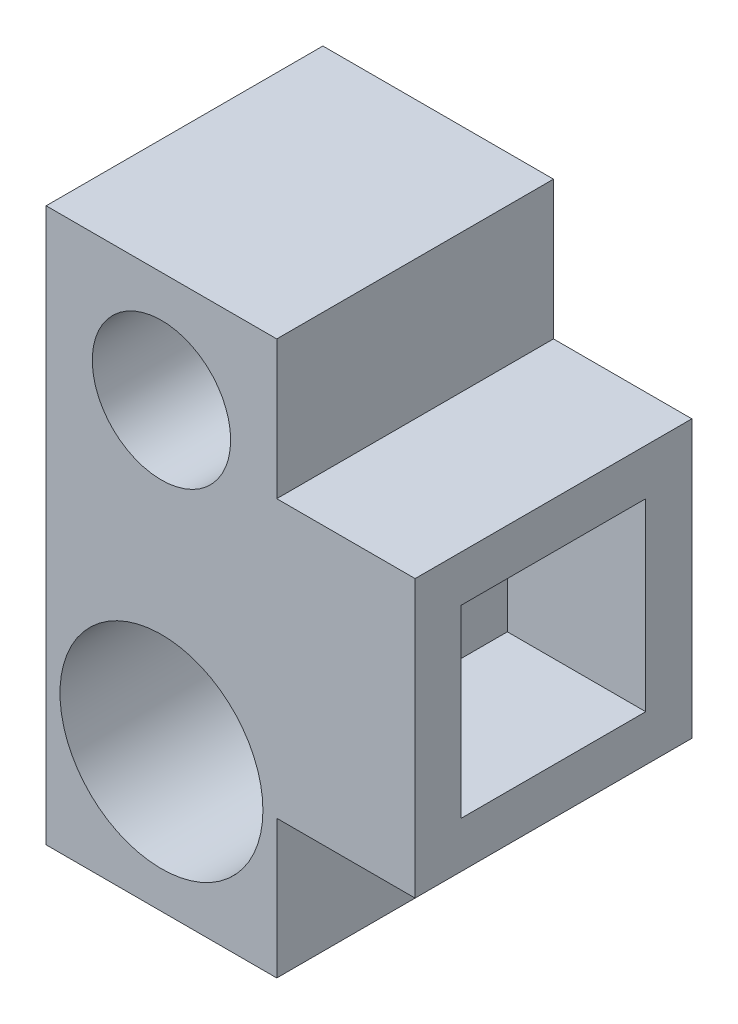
ISO-10303-21;
HEADER;
FILE_DESCRIPTION(('STEP AP214'),'2;1');
FILE_NAME('part.step','',(''),(''),'','','');
FILE_SCHEMA(('AUTOMOTIVE_DESIGN { 1 0 10303 214 1 1 1 1 }'));
ENDSEC;
DATA;
#1=APPLICATION_CONTEXT('core data for automotive mechanical design processes');
#2=APPLICATION_PROTOCOL_DEFINITION('international standard','automotive_design',2000,#1);
#3=PRODUCT_CONTEXT('',#1,'mechanical');
#4=PRODUCT('Part','Part','',(#3));
#5=PRODUCT_RELATED_PRODUCT_CATEGORY('part','',(#4));
#6=PRODUCT_DEFINITION_FORMATION('','',#4);
#7=PRODUCT_DEFINITION_CONTEXT('part definition',#1,'design');
#8=PRODUCT_DEFINITION('design','',#6,#7);
#9=PRODUCT_DEFINITION_SHAPE('','',#8);
#10=(LENGTH_UNIT() NAMED_UNIT(*) SI_UNIT(.MILLI.,.METRE.));
#11=(NAMED_UNIT(*) PLANE_ANGLE_UNIT() SI_UNIT($,.RADIAN.));
#12=(NAMED_UNIT(*) SI_UNIT($,.STERADIAN.) SOLID_ANGLE_UNIT());
#13=UNCERTAINTY_MEASURE_WITH_UNIT(LENGTH_MEASURE(1.E-05),#10,'distance_accuracy_value','');
#14=(GEOMETRIC_REPRESENTATION_CONTEXT(3) GLOBAL_UNCERTAINTY_ASSIGNED_CONTEXT((#13)) GLOBAL_UNIT_ASSIGNED_CONTEXT((#10,
#11,#12)) REPRESENTATION_CONTEXT('',''));
#15=CARTESIAN_POINT('',(0.,0.,0.));
#16=DIRECTION('',(0.,0.,1.));
#17=DIRECTION('',(1.,0.,0.));
#18=AXIS2_PLACEMENT_3D('',#15,#16,#17);
#19=CARTESIAN_POINT('',(-3.80717264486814,-20.0781660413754,14.9999999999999));
#20=DIRECTION('',(-1.,0.,0.));
#21=DIRECTION('',(0.,-1.,0.));
#22=AXIS2_PLACEMENT_3D('',#19,#20,#21);
#23=PLANE('',#22);
#24=DIRECTION('',(0.,0.,-1.));
#25=VECTOR('',#24,1.);
#26=CARTESIAN_POINT('',(-3.80717264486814,-5.0781660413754,14.9999999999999));
#27=LINE('',#26,#25);
#28=CARTESIAN_POINT('',(-3.80717264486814,-5.0781660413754,14.9999999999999));
#29=VERTEX_POINT('',#28);
#30=CARTESIAN_POINT('',(-3.80717264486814,-5.0781660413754,-15.0000000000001));
#31=VERTEX_POINT('',#30);
#32=EDGE_CURVE('E69',#29,#31,#27,.T.);
#33=ORIENTED_EDGE('',*,*,#32,.F.);
#34=DIRECTION('',(0.,1.,0.));
#35=VECTOR('',#34,1.);
#36=CARTESIAN_POINT('',(-3.80717264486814,-20.0781660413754,14.9999999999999));
#37=LINE('',#36,#35);
#38=CARTESIAN_POINT('',(-3.80717264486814,-20.0781660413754,14.9999999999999));
#39=VERTEX_POINT('',#38);
#40=EDGE_CURVE('E185',#39,#29,#37,.T.);
#41=ORIENTED_EDGE('',*,*,#40,.F.);
#42=DIRECTION('',(0.,0.,-1.));
#43=VECTOR('',#42,1.);
#44=CARTESIAN_POINT('',(-3.80717264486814,-20.0781660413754,14.9999999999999));
#45=LINE('',#44,#43);
#46=CARTESIAN_POINT('',(-3.80717264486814,-20.0781660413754,-15.0000000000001));
#47=VERTEX_POINT('',#46);
#48=EDGE_CURVE('E166',#39,#47,#45,.T.);
#49=ORIENTED_EDGE('',*,*,#48,.T.);
#50=DIRECTION('',(0.,1.,0.));
#51=VECTOR('',#50,1.);
#52=CARTESIAN_POINT('',(-3.80717264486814,-20.0781660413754,-15.0000000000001));
#53=LINE('',#52,#51);
#54=EDGE_CURVE('E144',#47,#31,#53,.T.);
#55=ORIENTED_EDGE('',*,*,#54,.T.);
#56=EDGE_LOOP('',(#33,#41,#49,#55));
#57=FACE_BOUND('',#56,.T.);
#58=ADVANCED_FACE('F45',(#57),#23,.F.);
#59=DIRECTION('',(0.,0.,1.));
#60=VECTOR('',#59,1.);
#61=CARTESIAN_POINT('',(-3.80717264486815,24.9218339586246,14.9999999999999));
#62=LINE('',#61,#60);
#63=CARTESIAN_POINT('',(-3.80717264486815,24.9218339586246,-15.0000000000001));
#64=VERTEX_POINT('',#63);
#65=CARTESIAN_POINT('',(-3.80717264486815,24.9218339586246,14.9999999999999));
#66=VERTEX_POINT('',#65);
#67=EDGE_CURVE('E223',#64,#66,#62,.T.);
#68=ORIENTED_EDGE('',*,*,#67,.F.);
#69=CARTESIAN_POINT('',(-3.80717264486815,39.9218339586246,-15.0000000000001));
#70=VERTEX_POINT('',#69);
#71=EDGE_CURVE('E176',#64,#70,#53,.T.);
#72=ORIENTED_EDGE('',*,*,#71,.T.);
#73=DIRECTION('',(0.,0.,-1.));
#74=VECTOR('',#73,1.);
#75=CARTESIAN_POINT('',(-3.80717264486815,39.9218339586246,14.9999999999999));
#76=LINE('',#75,#74);
#77=CARTESIAN_POINT('',(-3.80717264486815,39.9218339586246,14.9999999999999));
#78=VERTEX_POINT('',#77);
#79=EDGE_CURVE('E11',#78,#70,#76,.T.);
#80=ORIENTED_EDGE('',*,*,#79,.F.);
#81=EDGE_CURVE('E150',#66,#78,#37,.T.);
#82=ORIENTED_EDGE('',*,*,#81,.F.);
#83=EDGE_LOOP('',(#68,#72,#80,#82));
#84=FACE_BOUND('',#83,.T.);
#85=ADVANCED_FACE('F301',(#84),#23,.F.);
#86=CARTESIAN_POINT('',(-16.3071726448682,9.9218339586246,14.9999999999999));
#87=DIRECTION('',(0.,0.,-1.));
#88=DIRECTION('',(-1.,0.,0.));
#89=AXIS2_PLACEMENT_3D('',#86,#87,#88);
#90=PLANE('',#89);
#91=DIRECTION('',(0.,-1.,0.));
#92=VECTOR('',#91,1.);
#93=CARTESIAN_POINT('',(-28.8071726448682,-20.0781660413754,14.9999999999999));
#94=LINE('',#93,#92);
#95=CARTESIAN_POINT('',(-28.8071726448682,39.9218339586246,14.9999999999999));
#96=VERTEX_POINT('',#95);
#97=CARTESIAN_POINT('',(-28.8071726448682,-20.0781660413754,14.9999999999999));
#98=VERTEX_POINT('',#97);
#99=EDGE_CURVE('E179',#96,#98,#94,.T.);
#100=ORIENTED_EDGE('',*,*,#99,.T.);
#101=DIRECTION('',(1.,0.,0.));
#102=VECTOR('',#101,1.);
#103=CARTESIAN_POINT('',(-28.8071726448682,-20.0781660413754,14.9999999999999));
#104=LINE('',#103,#102);
#105=EDGE_CURVE('E164',#98,#39,#104,.T.);
#106=ORIENTED_EDGE('',*,*,#105,.T.);
#107=ORIENTED_EDGE('',*,*,#40,.T.);
#108=DIRECTION('',(-1.,0.,0.));
#109=VECTOR('',#108,1.);
#110=CARTESIAN_POINT('',(11.1928273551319,-5.07816604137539,14.9999999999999));
#111=LINE('',#110,#109);
#112=CARTESIAN_POINT('',(11.1928273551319,-5.07816604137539,14.9999999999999));
#113=VERTEX_POINT('',#112);
#114=EDGE_CURVE('E212',#113,#29,#111,.T.);
#115=ORIENTED_EDGE('',*,*,#114,.F.);
#116=DIRECTION('',(0.,-1.,0.));
#117=VECTOR('',#116,1.);
#118=CARTESIAN_POINT('',(11.1928273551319,24.9218339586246,14.9999999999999));
#119=LINE('',#118,#117);
#120=CARTESIAN_POINT('',(11.1928273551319,24.9218339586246,14.9999999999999));
#121=VERTEX_POINT('',#120);
#122=EDGE_CURVE('E230',#121,#113,#119,.T.);
#123=ORIENTED_EDGE('',*,*,#122,.F.);
#124=DIRECTION('',(-1.,0.,0.));
#125=VECTOR('',#124,1.);
#126=CARTESIAN_POINT('',(11.1928273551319,24.9218339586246,14.9999999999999));
#127=LINE('',#126,#125);
#128=EDGE_CURVE('E208',#121,#66,#127,.T.);
#129=ORIENTED_EDGE('',*,*,#128,.T.);
#130=ORIENTED_EDGE('',*,*,#81,.T.);
#131=DIRECTION('',(-1.,0.,0.));
#132=VECTOR('',#131,1.);
#133=CARTESIAN_POINT('',(-28.8071726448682,39.9218339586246,14.9999999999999));
#134=LINE('',#133,#132);
#135=EDGE_CURVE('E182',#78,#96,#134,.T.);
#136=ORIENTED_EDGE('',*,*,#135,.T.);
#137=EDGE_LOOP('',(#100,#106,#107,#115,#123,#129,#130,#136));
#138=FACE_BOUND('',#137,.T.);
#139=CARTESIAN_POINT('',(-16.3071726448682,27.9218339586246,14.9999999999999));
#140=DIRECTION('',(0.,0.,1.));
#141=DIRECTION('',(1.,0.,0.));
#142=AXIS2_PLACEMENT_3D('',#139,#140,#141);
#143=CIRCLE('',#142,7.5);
#144=CARTESIAN_POINT('',(-8.80717264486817,27.9218339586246,14.9999999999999));
#145=VERTEX_POINT('',#144);
#146=EDGE_CURVE('E192',#145,#145,#143,.T.);
#147=ORIENTED_EDGE('',*,*,#146,.F.);
#148=EDGE_LOOP('',(#147));
#149=FACE_BOUND('',#148,.T.);
#150=CARTESIAN_POINT('',(-16.3071726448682,-5.0781660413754,14.9999999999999));
#151=DIRECTION('',(0.,0.,1.));
#152=DIRECTION('',(1.,0.,0.));
#153=AXIS2_PLACEMENT_3D('',#150,#151,#152);
#154=CIRCLE('',#153,11.);
#155=CARTESIAN_POINT('',(-5.30717264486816,-5.0781660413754,14.9999999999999));
#156=VERTEX_POINT('',#155);
#157=EDGE_CURVE('E193',#156,#156,#154,.T.);
#158=ORIENTED_EDGE('',*,*,#157,.F.);
#159=EDGE_LOOP('',(#158));
#160=FACE_BOUND('',#159,.T.);
#161=ADVANCED_FACE('F307',(#138,#149,#160),#90,.F.);
#162=CARTESIAN_POINT('',(-16.3071726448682,9.9218339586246,-15.0000000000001));
#163=DIRECTION('',(0.,0.,-1.));
#164=DIRECTION('',(-1.,0.,0.));
#165=AXIS2_PLACEMENT_3D('',#162,#163,#164);
#166=PLANE('',#165);
#167=DIRECTION('',(1.,0.,0.));
#168=VECTOR('',#167,1.);
#169=CARTESIAN_POINT('',(-28.8071726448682,-20.0781660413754,-15.0000000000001));
#170=LINE('',#169,#168);
#171=CARTESIAN_POINT('',(-28.8071726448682,-20.0781660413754,-15.0000000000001));
#172=VERTEX_POINT('',#171);
#173=EDGE_CURVE('E137',#172,#47,#170,.T.);
#174=ORIENTED_EDGE('',*,*,#173,.F.);
#175=DIRECTION('',(0.,-1.,0.));
#176=VECTOR('',#175,1.);
#177=CARTESIAN_POINT('',(-28.8071726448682,-20.0781660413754,-15.0000000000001));
#178=LINE('',#177,#176);
#179=CARTESIAN_POINT('',(-28.8071726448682,39.9218339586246,-15.0000000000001));
#180=VERTEX_POINT('',#179);
#181=EDGE_CURVE('E142',#180,#172,#178,.T.);
#182=ORIENTED_EDGE('',*,*,#181,.F.);
#183=DIRECTION('',(-1.,0.,0.));
#184=VECTOR('',#183,1.);
#185=CARTESIAN_POINT('',(-28.8071726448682,39.9218339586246,-15.0000000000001));
#186=LINE('',#185,#184);
#187=EDGE_CURVE('E160',#70,#180,#186,.T.);
#188=ORIENTED_EDGE('',*,*,#187,.F.);
#189=ORIENTED_EDGE('',*,*,#71,.F.);
#190=DIRECTION('',(-1.,0.,0.));
#191=VECTOR('',#190,1.);
#192=CARTESIAN_POINT('',(11.1928273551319,24.9218339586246,-15.0000000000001));
#193=LINE('',#192,#191);
#194=CARTESIAN_POINT('',(11.1928273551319,24.9218339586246,-15.0000000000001));
#195=VERTEX_POINT('',#194);
#196=EDGE_CURVE('E201',#195,#64,#193,.T.);
#197=ORIENTED_EDGE('',*,*,#196,.F.);
#198=DIRECTION('',(0.,1.,0.));
#199=VECTOR('',#198,1.);
#200=CARTESIAN_POINT('',(11.1928273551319,24.9218339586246,-15.0000000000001));
#201=LINE('',#200,#199);
#202=CARTESIAN_POINT('',(11.1928273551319,-5.07816604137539,-15.0000000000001));
#203=VERTEX_POINT('',#202);
#204=EDGE_CURVE('E222',#203,#195,#201,.T.);
#205=ORIENTED_EDGE('',*,*,#204,.F.);
#206=DIRECTION('',(-1.,0.,0.));
#207=VECTOR('',#206,1.);
#208=CARTESIAN_POINT('',(11.1928273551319,-5.07816604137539,-15.0000000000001));
#209=LINE('',#208,#207);
#210=EDGE_CURVE('E216',#203,#31,#209,.T.);
#211=ORIENTED_EDGE('',*,*,#210,.T.);
#212=ORIENTED_EDGE('',*,*,#54,.F.);
#213=EDGE_LOOP('',(#174,#182,#188,#189,#197,#205,#211,#212));
#214=FACE_BOUND('',#213,.T.);
#215=CARTESIAN_POINT('',(-16.3071726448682,27.9218339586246,-15.0000000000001));
#216=DIRECTION('',(0.,0.,1.));
#217=DIRECTION('',(1.,0.,0.));
#218=AXIS2_PLACEMENT_3D('',#215,#216,#217);
#219=CIRCLE('',#218,7.5);
#220=CARTESIAN_POINT('',(-8.80717264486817,27.9218339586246,-15.0000000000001));
#221=VERTEX_POINT('',#220);
#222=EDGE_CURVE('E188',#221,#221,#219,.T.);
#223=ORIENTED_EDGE('',*,*,#222,.T.);
#224=EDGE_LOOP('',(#223));
#225=FACE_BOUND('',#224,.T.);
#226=CARTESIAN_POINT('',(-16.3071726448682,-5.0781660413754,-15.0000000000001));
#227=DIRECTION('',(0.,0.,1.));
#228=DIRECTION('',(1.,0.,0.));
#229=AXIS2_PLACEMENT_3D('',#226,#227,#228);
#230=CIRCLE('',#229,11.);
#231=CARTESIAN_POINT('',(-5.30717264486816,-5.0781660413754,-15.0000000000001));
#232=VERTEX_POINT('',#231);
#233=EDGE_CURVE('E197',#232,#232,#230,.T.);
#234=ORIENTED_EDGE('',*,*,#233,.T.);
#235=EDGE_LOOP('',(#234));
#236=FACE_BOUND('',#235,.T.);
#237=ADVANCED_FACE('F139',(#214,#225,#236),#166,.T.);
#238=CARTESIAN_POINT('',(-28.8071726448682,39.9218339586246,14.9999999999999));
#239=DIRECTION('',(0.,-1.,0.));
#240=DIRECTION('',(1.,0.,0.));
#241=AXIS2_PLACEMENT_3D('',#238,#239,#240);
#242=PLANE('',#241);
#243=ORIENTED_EDGE('',*,*,#187,.T.);
#244=DIRECTION('',(0.,0.,-1.));
#245=VECTOR('',#244,1.);
#246=CARTESIAN_POINT('',(-28.8071726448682,39.9218339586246,14.9999999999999));
#247=LINE('',#246,#245);
#248=EDGE_CURVE('E54',#96,#180,#247,.T.);
#249=ORIENTED_EDGE('',*,*,#248,.F.);
#250=ORIENTED_EDGE('',*,*,#135,.F.);
#251=ORIENTED_EDGE('',*,*,#79,.T.);
#252=EDGE_LOOP('',(#243,#249,#250,#251));
#253=FACE_BOUND('',#252,.T.);
#254=ADVANCED_FACE('F332',(#253),#242,.F.);
#255=CARTESIAN_POINT('',(-28.8071726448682,-20.0781660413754,14.9999999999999));
#256=DIRECTION('',(1.,0.,0.));
#257=DIRECTION('',(0.,1.,0.));
#258=AXIS2_PLACEMENT_3D('',#255,#256,#257);
#259=PLANE('',#258);
#260=DIRECTION('',(0.,0.,-1.));
#261=VECTOR('',#260,1.);
#262=CARTESIAN_POINT('',(-28.8071726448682,-20.0781660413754,14.9999999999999));
#263=LINE('',#262,#261);
#264=EDGE_CURVE('E157',#98,#172,#263,.T.);
#265=ORIENTED_EDGE('',*,*,#264,.F.);
#266=ORIENTED_EDGE('',*,*,#99,.F.);
#267=ORIENTED_EDGE('',*,*,#248,.T.);
#268=ORIENTED_EDGE('',*,*,#181,.T.);
#269=EDGE_LOOP('',(#265,#266,#267,#268));
#270=FACE_BOUND('',#269,.T.);
#271=ADVANCED_FACE('F155',(#270),#259,.F.);
#272=CARTESIAN_POINT('',(-28.8071726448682,-20.0781660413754,14.9999999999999));
#273=DIRECTION('',(0.,1.,0.));
#274=DIRECTION('',(-1.,0.,0.));
#275=AXIS2_PLACEMENT_3D('',#272,#273,#274);
#276=PLANE('',#275);
#277=ORIENTED_EDGE('',*,*,#105,.F.);
#278=ORIENTED_EDGE('',*,*,#264,.T.);
#279=ORIENTED_EDGE('',*,*,#173,.T.);
#280=ORIENTED_EDGE('',*,*,#48,.F.);
#281=EDGE_LOOP('',(#277,#278,#279,#280));
#282=FACE_BOUND('',#281,.T.);
#283=ADVANCED_FACE('F163',(#282),#276,.F.);
#284=CARTESIAN_POINT('',(-16.3071726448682,27.9218339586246,14.9999999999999));
#285=DIRECTION('',(0.,0.,-1.));
#286=DIRECTION('',(-1.,0.,0.));
#287=AXIS2_PLACEMENT_3D('',#284,#285,#286);
#288=CYLINDRICAL_SURFACE('',#287,7.5);
#289=ORIENTED_EDGE('',*,*,#146,.T.);
#290=EDGE_LOOP('',(#289));
#291=FACE_BOUND('',#290,.T.);
#292=ORIENTED_EDGE('',*,*,#222,.F.);
#293=EDGE_LOOP('',(#292));
#294=FACE_BOUND('',#293,.T.);
#295=ADVANCED_FACE('F342',(#291,#294),#288,.F.);
#296=CARTESIAN_POINT('',(-16.3071726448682,-5.0781660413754,14.9999999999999));
#297=DIRECTION('',(0.,0.,-1.));
#298=DIRECTION('',(-1.,0.,0.));
#299=AXIS2_PLACEMENT_3D('',#296,#297,#298);
#300=CYLINDRICAL_SURFACE('',#299,11.);
#301=ORIENTED_EDGE('',*,*,#157,.T.);
#302=EDGE_LOOP('',(#301));
#303=FACE_BOUND('',#302,.T.);
#304=ORIENTED_EDGE('',*,*,#233,.F.);
#305=EDGE_LOOP('',(#304));
#306=FACE_BOUND('',#305,.T.);
#307=ADVANCED_FACE('F346',(#303,#306),#300,.F.);
#308=CARTESIAN_POINT('',(11.1928273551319,9.92183395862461,0.));
#309=DIRECTION('',(1.,0.,0.));
#310=DIRECTION('',(0.,1.,0.));
#311=AXIS2_PLACEMENT_3D('',#308,#309,#310);
#312=PLANE('',#311);
#313=ORIENTED_EDGE('',*,*,#204,.T.);
#314=DIRECTION('',(0.,0.,1.));
#315=VECTOR('',#314,1.);
#316=CARTESIAN_POINT('',(11.1928273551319,24.9218339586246,14.9999999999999));
#317=LINE('',#316,#315);
#318=EDGE_CURVE('E233',#195,#121,#317,.T.);
#319=ORIENTED_EDGE('',*,*,#318,.T.);
#320=ORIENTED_EDGE('',*,*,#122,.T.);
#321=DIRECTION('',(0.,0.,-1.));
#322=VECTOR('',#321,1.);
#323=CARTESIAN_POINT('',(11.1928273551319,-5.07816604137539,14.9999999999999));
#324=LINE('',#323,#322);
#325=EDGE_CURVE('E219',#113,#203,#324,.T.);
#326=ORIENTED_EDGE('',*,*,#325,.T.);
#327=EDGE_LOOP('',(#313,#319,#320,#326));
#328=FACE_BOUND('',#327,.T.);
#329=DIRECTION('',(0.,0.,1.));
#330=VECTOR('',#329,1.);
#331=CARTESIAN_POINT('',(11.1928273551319,19.9218339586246,9.99999999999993));
#332=LINE('',#331,#330);
#333=CARTESIAN_POINT('',(11.1928273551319,19.9218339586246,-10.0000000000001));
#334=VERTEX_POINT('',#333);
#335=CARTESIAN_POINT('',(11.1928273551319,19.9218339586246,9.99999999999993));
#336=VERTEX_POINT('',#335);
#337=EDGE_CURVE('E274',#334,#336,#332,.T.);
#338=ORIENTED_EDGE('',*,*,#337,.F.);
#339=DIRECTION('',(0.,1.,0.));
#340=VECTOR('',#339,1.);
#341=CARTESIAN_POINT('',(11.1928273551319,19.9218339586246,-10.0000000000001));
#342=LINE('',#341,#340);
#343=CARTESIAN_POINT('',(11.1928273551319,-0.0781660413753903,-10.0000000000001));
#344=VERTEX_POINT('',#343);
#345=EDGE_CURVE('E255',#344,#334,#342,.T.);
#346=ORIENTED_EDGE('',*,*,#345,.F.);
#347=DIRECTION('',(0.,0.,-1.));
#348=VECTOR('',#347,1.);
#349=CARTESIAN_POINT('',(11.1928273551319,-0.0781660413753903,9.99999999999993));
#350=LINE('',#349,#348);
#351=CARTESIAN_POINT('',(11.1928273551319,-0.0781660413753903,9.99999999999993));
#352=VERTEX_POINT('',#351);
#353=EDGE_CURVE('E250',#352,#344,#350,.T.);
#354=ORIENTED_EDGE('',*,*,#353,.F.);
#355=DIRECTION('',(0.,-1.,0.));
#356=VECTOR('',#355,1.);
#357=CARTESIAN_POINT('',(11.1928273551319,19.9218339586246,9.99999999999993));
#358=LINE('',#357,#356);
#359=EDGE_CURVE('E270',#336,#352,#358,.T.);
#360=ORIENTED_EDGE('',*,*,#359,.F.);
#361=EDGE_LOOP('',(#338,#346,#354,#360));
#362=FACE_BOUND('',#361,.T.);
#363=ADVANCED_FACE('F289',(#328,#362),#312,.T.);
#364=CARTESIAN_POINT('',(11.1928273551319,24.9218339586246,14.9999999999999));
#365=DIRECTION('',(0.,-1.,0.));
#366=DIRECTION('',(1.,0.,0.));
#367=AXIS2_PLACEMENT_3D('',#364,#365,#366);
#368=PLANE('',#367);
#369=ORIENTED_EDGE('',*,*,#67,.T.);
#370=ORIENTED_EDGE('',*,*,#128,.F.);
#371=ORIENTED_EDGE('',*,*,#318,.F.);
#372=ORIENTED_EDGE('',*,*,#196,.T.);
#373=EDGE_LOOP('',(#369,#370,#371,#372));
#374=FACE_BOUND('',#373,.T.);
#375=ADVANCED_FACE('F321',(#374),#368,.F.);
#376=CARTESIAN_POINT('',(11.1928273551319,-5.07816604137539,14.9999999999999));
#377=DIRECTION('',(0.,1.,0.));
#378=DIRECTION('',(-1.,0.,0.));
#379=AXIS2_PLACEMENT_3D('',#376,#377,#378);
#380=PLANE('',#379);
#381=ORIENTED_EDGE('',*,*,#32,.T.);
#382=ORIENTED_EDGE('',*,*,#210,.F.);
#383=ORIENTED_EDGE('',*,*,#325,.F.);
#384=ORIENTED_EDGE('',*,*,#114,.T.);
#385=EDGE_LOOP('',(#381,#382,#383,#384));
#386=FACE_BOUND('',#385,.T.);
#387=ADVANCED_FACE('F327',(#386),#380,.F.);
#388=CARTESIAN_POINT('',(11.1928273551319,19.9218339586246,-10.0000000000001));
#389=DIRECTION('',(0.,0.,1.));
#390=DIRECTION('',(0.,-1.,0.));
#391=AXIS2_PLACEMENT_3D('',#388,#389,#390);
#392=PLANE('',#391);
#393=DIRECTION('',(0.,1.,0.));
#394=VECTOR('',#393,1.);
#395=CARTESIAN_POINT('',(-3.80717264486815,19.9218339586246,-10.0000000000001));
#396=LINE('',#395,#394);
#397=CARTESIAN_POINT('',(-3.80717264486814,-0.0781660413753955,-10.0000000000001));
#398=VERTEX_POINT('',#397);
#399=CARTESIAN_POINT('',(-3.80717264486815,19.9218339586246,-10.0000000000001));
#400=VERTEX_POINT('',#399);
#401=EDGE_CURVE('E264',#398,#400,#396,.T.);
#402=ORIENTED_EDGE('',*,*,#401,.F.);
#403=DIRECTION('',(-1.,0.,0.));
#404=VECTOR('',#403,1.);
#405=CARTESIAN_POINT('',(11.1928273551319,-0.0781660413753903,-10.0000000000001));
#406=LINE('',#405,#404);
#407=EDGE_CURVE('E61',#344,#398,#406,.T.);
#408=ORIENTED_EDGE('',*,*,#407,.F.);
#409=ORIENTED_EDGE('',*,*,#345,.T.);
#410=DIRECTION('',(-1.,0.,0.));
#411=VECTOR('',#410,1.);
#412=CARTESIAN_POINT('',(11.1928273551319,19.9218339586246,-10.0000000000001));
#413=LINE('',#412,#411);
#414=EDGE_CURVE('E227',#334,#400,#413,.T.);
#415=ORIENTED_EDGE('',*,*,#414,.T.);
#416=EDGE_LOOP('',(#402,#408,#409,#415));
#417=FACE_BOUND('',#416,.T.);
#418=ADVANCED_FACE('F281',(#417),#392,.T.);
#419=CARTESIAN_POINT('',(11.1928273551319,19.9218339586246,9.99999999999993));
#420=DIRECTION('',(0.,-1.,0.));
#421=DIRECTION('',(1.,0.,0.));
#422=AXIS2_PLACEMENT_3D('',#419,#420,#421);
#423=PLANE('',#422);
#424=DIRECTION('',(0.,0.,1.));
#425=VECTOR('',#424,1.);
#426=CARTESIAN_POINT('',(-3.80717264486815,19.9218339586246,9.99999999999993));
#427=LINE('',#426,#425);
#428=CARTESIAN_POINT('',(-3.80717264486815,19.9218339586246,9.99999999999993));
#429=VERTEX_POINT('',#428);
#430=EDGE_CURVE('E260',#400,#429,#427,.T.);
#431=ORIENTED_EDGE('',*,*,#430,.F.);
#432=ORIENTED_EDGE('',*,*,#414,.F.);
#433=ORIENTED_EDGE('',*,*,#337,.T.);
#434=DIRECTION('',(-1.,0.,0.));
#435=VECTOR('',#434,1.);
#436=CARTESIAN_POINT('',(11.1928273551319,19.9218339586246,9.99999999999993));
#437=LINE('',#436,#435);
#438=EDGE_CURVE('E242',#336,#429,#437,.T.);
#439=ORIENTED_EDGE('',*,*,#438,.T.);
#440=EDGE_LOOP('',(#431,#432,#433,#439));
#441=FACE_BOUND('',#440,.T.);
#442=ADVANCED_FACE('F286',(#441),#423,.T.);
#443=CARTESIAN_POINT('',(11.1928273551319,19.9218339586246,9.99999999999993));
#444=DIRECTION('',(0.,0.,-1.));
#445=DIRECTION('',(0.,1.,0.));
#446=AXIS2_PLACEMENT_3D('',#443,#444,#445);
#447=PLANE('',#446);
#448=DIRECTION('',(0.,-1.,0.));
#449=VECTOR('',#448,1.);
#450=CARTESIAN_POINT('',(-3.80717264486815,19.9218339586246,9.99999999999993));
#451=LINE('',#450,#449);
#452=CARTESIAN_POINT('',(-3.80717264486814,-0.0781660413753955,9.99999999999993));
#453=VERTEX_POINT('',#452);
#454=EDGE_CURVE('E256',#429,#453,#451,.T.);
#455=ORIENTED_EDGE('',*,*,#454,.F.);
#456=ORIENTED_EDGE('',*,*,#438,.F.);
#457=ORIENTED_EDGE('',*,*,#359,.T.);
#458=DIRECTION('',(-1.,0.,0.));
#459=VECTOR('',#458,1.);
#460=CARTESIAN_POINT('',(11.1928273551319,-0.0781660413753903,9.99999999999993));
#461=LINE('',#460,#459);
#462=EDGE_CURVE('E245',#352,#453,#461,.T.);
#463=ORIENTED_EDGE('',*,*,#462,.T.);
#464=EDGE_LOOP('',(#455,#456,#457,#463));
#465=FACE_BOUND('',#464,.T.);
#466=ADVANCED_FACE('F292',(#465),#447,.T.);
#467=CARTESIAN_POINT('',(11.1928273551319,-0.0781660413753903,9.99999999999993));
#468=DIRECTION('',(0.,1.,0.));
#469=DIRECTION('',(-1.,0.,0.));
#470=AXIS2_PLACEMENT_3D('',#467,#468,#469);
#471=PLANE('',#470);
#472=DIRECTION('',(0.,0.,-1.));
#473=VECTOR('',#472,1.);
#474=CARTESIAN_POINT('',(-3.80717264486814,-0.0781660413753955,9.99999999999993));
#475=LINE('',#474,#473);
#476=EDGE_CURVE('E251',#453,#398,#475,.T.);
#477=ORIENTED_EDGE('',*,*,#476,.F.);
#478=ORIENTED_EDGE('',*,*,#462,.F.);
#479=ORIENTED_EDGE('',*,*,#353,.T.);
#480=ORIENTED_EDGE('',*,*,#407,.T.);
#481=EDGE_LOOP('',(#477,#478,#479,#480));
#482=FACE_BOUND('',#481,.T.);
#483=ADVANCED_FACE('F294',(#482),#471,.T.);
#484=ORIENTED_EDGE('',*,*,#476,.T.);
#485=ORIENTED_EDGE('',*,*,#401,.T.);
#486=ORIENTED_EDGE('',*,*,#430,.T.);
#487=ORIENTED_EDGE('',*,*,#454,.T.);
#488=EDGE_LOOP('',(#484,#485,#486,#487));
#489=FACE_BOUND('',#488,.T.);
#490=ADVANCED_FACE('F47',(#489),#23,.F.);
#491=CLOSED_SHELL('',(#58,#85,#161,#237,#254,#271,#283,#295,#307,#363,#375,#387,#418,#442,#466,
#483,#490));
#492=MANIFOLD_SOLID_BREP('B2',#491);
#493=ADVANCED_BREP_SHAPE_REPRESENTATION('',(#18,#492),#14);
#494=SHAPE_DEFINITION_REPRESENTATION(#9,#493);
ENDSEC;
END-ISO-10303-21;
